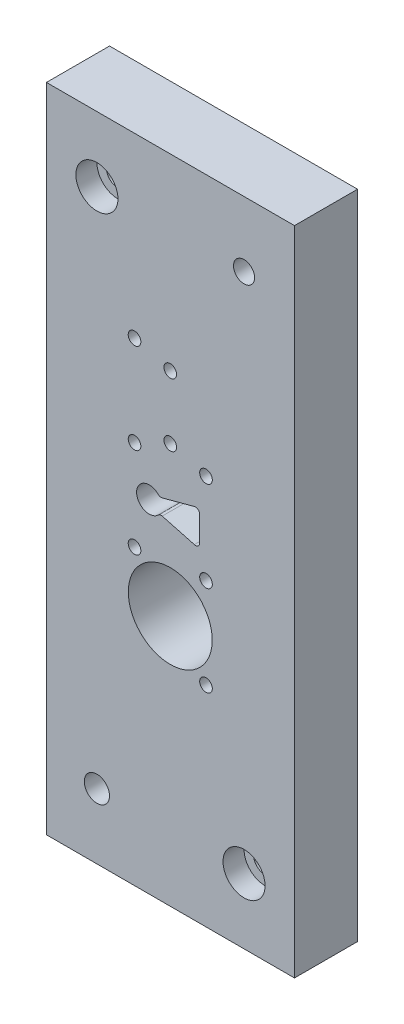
ISO-10303-21;
HEADER;
FILE_DESCRIPTION(('STEP AP214'),'2;1');
FILE_NAME('part.step','',(''),(''),'','','');
FILE_SCHEMA(('AUTOMOTIVE_DESIGN { 1 0 10303 214 1 1 1 1 }'));
ENDSEC;
DATA;
#1=APPLICATION_CONTEXT('core data for automotive mechanical design processes');
#2=APPLICATION_PROTOCOL_DEFINITION('international standard','automotive_design',2000,#1);
#3=PRODUCT_CONTEXT('',#1,'mechanical');
#4=PRODUCT('Part','Part','',(#3));
#5=PRODUCT_RELATED_PRODUCT_CATEGORY('part','',(#4));
#6=PRODUCT_DEFINITION_FORMATION('','',#4);
#7=PRODUCT_DEFINITION_CONTEXT('part definition',#1,'design');
#8=PRODUCT_DEFINITION('design','',#6,#7);
#9=PRODUCT_DEFINITION_SHAPE('','',#8);
#10=(LENGTH_UNIT() NAMED_UNIT(*) SI_UNIT(.MILLI.,.METRE.));
#11=(NAMED_UNIT(*) PLANE_ANGLE_UNIT() SI_UNIT($,.RADIAN.));
#12=(NAMED_UNIT(*) SI_UNIT($,.STERADIAN.) SOLID_ANGLE_UNIT());
#13=UNCERTAINTY_MEASURE_WITH_UNIT(LENGTH_MEASURE(1.E-05),#10,'distance_accuracy_value','');
#14=(GEOMETRIC_REPRESENTATION_CONTEXT(3) GLOBAL_UNCERTAINTY_ASSIGNED_CONTEXT((#13)) GLOBAL_UNIT_ASSIGNED_CONTEXT((#10,
#11,#12)) REPRESENTATION_CONTEXT('',''));
#15=CARTESIAN_POINT('',(0.,0.,0.));
#16=DIRECTION('',(0.,0.,1.));
#17=DIRECTION('',(1.,0.,0.));
#18=AXIS2_PLACEMENT_3D('',#15,#16,#17);
#19=CARTESIAN_POINT('',(-29.5,-77.5,15.));
#20=DIRECTION('',(0.,0.,1.));
#21=DIRECTION('',(1.,0.,0.));
#22=AXIS2_PLACEMENT_3D('',#19,#20,#21);
#23=PLANE('',#22);
#24=CARTESIAN_POINT('',(-2.22157287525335,0.971572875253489,15.));
#25=DIRECTION('',(0.,0.,-1.));
#26=DIRECTION('',(1.,0.,0.));
#27=AXIS2_PLACEMENT_3D('',#24,#25,#26);
#28=CIRCLE('',#27,0.99);
#29=CARTESIAN_POINT('',(-2.92160858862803,1.67160858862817,15.));
#30=VERTEX_POINT('',#29);
#31=CARTESIAN_POINT('',(-1.96534202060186,1.92783944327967,15.));
#32=VERTEX_POINT('',#31);
#33=EDGE_CURVE('E47',#30,#32,#28,.T.);
#34=ORIENTED_EDGE('',*,*,#33,.F.);
#35=CARTESIAN_POINT('',(-5.04999999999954,3.79999999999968,15.));
#36=DIRECTION('',(0.,0.,1.));
#37=DIRECTION('',(1.,0.,0.));
#38=AXIS2_PLACEMENT_3D('',#35,#36,#37);
#39=CIRCLE('',#38,3.01);
#40=CARTESIAN_POINT('',(-2.92160858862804,5.9283914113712,15.));
#41=VERTEX_POINT('',#40);
#42=EDGE_CURVE('E140',#41,#30,#39,.T.);
#43=ORIENTED_EDGE('',*,*,#42,.F.);
#44=CARTESIAN_POINT('',(-2.22157287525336,6.62842712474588,15.));
#45=DIRECTION('',(0.,0.,-1.));
#46=DIRECTION('',(1.,0.,0.));
#47=AXIS2_PLACEMENT_3D('',#44,#45,#46);
#48=CIRCLE('',#47,0.990000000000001);
#49=CARTESIAN_POINT('',(-1.96534202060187,5.6721605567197,15.));
#50=VERTEX_POINT('',#49);
#51=EDGE_CURVE('E143',#50,#41,#48,.T.);
#52=ORIENTED_EDGE('',*,*,#51,.F.);
#53=DIRECTION('',(-0.96592582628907,-0.258819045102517,0.));
#54=VECTOR('',#53,1.);
#55=CARTESIAN_POINT('',(5.68859276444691,7.72302620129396,15.));
#56=LINE('',#55,#54);
#57=CARTESIAN_POINT('',(5.68859276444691,7.72302620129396,15.));
#58=VERTEX_POINT('',#57);
#59=EDGE_CURVE('E171',#58,#50,#56,.T.);
#60=ORIENTED_EDGE('',*,*,#59,.F.);
#61=CARTESIAN_POINT('',(5.95000000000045,6.747441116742,15.));
#62=DIRECTION('',(0.,0.,1.));
#63=DIRECTION('',(1.,0.,0.));
#64=AXIS2_PLACEMENT_3D('',#61,#62,#63);
#65=CIRCLE('',#64,1.01);
#66=CARTESIAN_POINT('',(6.96000000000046,6.747441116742,15.));
#67=VERTEX_POINT('',#66);
#68=EDGE_CURVE('E168',#67,#58,#65,.T.);
#69=ORIENTED_EDGE('',*,*,#68,.F.);
#70=DIRECTION('',(0.,1.,0.));
#71=VECTOR('',#70,1.);
#72=CARTESIAN_POINT('',(6.96000000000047,0.85255888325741,15.));
#73=LINE('',#72,#71);
#74=CARTESIAN_POINT('',(6.96000000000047,0.85255888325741,15.));
#75=VERTEX_POINT('',#74);
#76=EDGE_CURVE('E165',#75,#67,#73,.T.);
#77=ORIENTED_EDGE('',*,*,#76,.F.);
#78=CARTESIAN_POINT('',(5.95000000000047,0.852558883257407,15.));
#79=DIRECTION('',(0.,0.,1.));
#80=DIRECTION('',(1.,0.,0.));
#81=AXIS2_PLACEMENT_3D('',#78,#79,#80);
#82=CIRCLE('',#81,1.01);
#83=CARTESIAN_POINT('',(5.68859276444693,-0.123026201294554,15.));
#84=VERTEX_POINT('',#83);
#85=EDGE_CURVE('E162',#84,#75,#82,.T.);
#86=ORIENTED_EDGE('',*,*,#85,.F.);
#87=DIRECTION('',(0.965925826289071,-0.258819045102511,0.));
#88=VECTOR('',#87,1.);
#89=CARTESIAN_POINT('',(-1.96534202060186,1.92783944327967,15.));
#90=LINE('',#89,#88);
#91=EDGE_CURVE('E160',#32,#84,#90,.T.);
#92=ORIENTED_EDGE('',*,*,#91,.F.);
#93=EDGE_LOOP('',(#34,#43,#52,#60,#69,#77,#86,#92));
#94=FACE_BOUND('',#93,.T.);
#95=CARTESIAN_POINT('',(-0.0499999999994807,-17.7000000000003,15.));
#96=DIRECTION('',(0.,0.,1.));
#97=DIRECTION('',(1.,0.,0.));
#98=AXIS2_PLACEMENT_3D('',#95,#96,#97);
#99=CIRCLE('',#98,9.98);
#100=CARTESIAN_POINT('',(9.93000000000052,-17.7000000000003,15.));
#101=VERTEX_POINT('',#100);
#102=EDGE_CURVE('E178',#101,#101,#99,.T.);
#103=ORIENTED_EDGE('',*,*,#102,.F.);
#104=EDGE_LOOP('',(#103));
#105=FACE_BOUND('',#104,.T.);
#106=CARTESIAN_POINT('',(8.45000000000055,-27.667948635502,15.));
#107=DIRECTION('',(0.,0.,1.));
#108=DIRECTION('',(1.,0.,0.));
#109=AXIS2_PLACEMENT_3D('',#106,#107,#108);
#110=CIRCLE('',#109,1.5035);
#111=CARTESIAN_POINT('',(9.95350000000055,-27.667948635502,15.));
#112=VERTEX_POINT('',#111);
#113=EDGE_CURVE('E193',#112,#112,#110,.T.);
#114=ORIENTED_EDGE('',*,*,#113,.F.);
#115=EDGE_LOOP('',(#114));
#116=FACE_BOUND('',#115,.T.);
#117=CARTESIAN_POINT('',(-8.5499999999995,-7.73205136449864,15.));
#118=DIRECTION('',(0.,0.,1.));
#119=DIRECTION('',(1.,0.,0.));
#120=AXIS2_PLACEMENT_3D('',#117,#118,#119);
#121=CIRCLE('',#120,1.5035);
#122=CARTESIAN_POINT('',(-7.0464999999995,-7.73205136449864,15.));
#123=VERTEX_POINT('',#122);
#124=EDGE_CURVE('E199',#123,#123,#121,.T.);
#125=ORIENTED_EDGE('',*,*,#124,.F.);
#126=EDGE_LOOP('',(#125));
#127=FACE_BOUND('',#126,.T.);
#128=CARTESIAN_POINT('',(8.45000000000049,-6.16794863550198,15.));
#129=DIRECTION('',(0.,0.,1.));
#130=DIRECTION('',(1.,0.,0.));
#131=AXIS2_PLACEMENT_3D('',#128,#129,#130);
#132=CIRCLE('',#131,1.5035);
#133=CARTESIAN_POINT('',(9.95350000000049,-6.16794863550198,15.));
#134=VERTEX_POINT('',#133);
#135=EDGE_CURVE('E205',#134,#134,#132,.T.);
#136=ORIENTED_EDGE('',*,*,#135,.F.);
#137=EDGE_LOOP('',(#136));
#138=FACE_BOUND('',#137,.T.);
#139=CARTESIAN_POINT('',(-8.54999999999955,13.7679486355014,15.));
#140=DIRECTION('',(0.,0.,1.));
#141=DIRECTION('',(1.,0.,0.));
#142=AXIS2_PLACEMENT_3D('',#139,#140,#141);
#143=CIRCLE('',#142,1.5035);
#144=CARTESIAN_POINT('',(-7.04649999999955,13.7679486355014,15.));
#145=VERTEX_POINT('',#144);
#146=EDGE_CURVE('E211',#145,#145,#143,.T.);
#147=ORIENTED_EDGE('',*,*,#146,.F.);
#148=EDGE_LOOP('',(#147));
#149=FACE_BOUND('',#148,.T.);
#150=CARTESIAN_POINT('',(8.45000000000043,15.332051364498,15.));
#151=DIRECTION('',(0.,0.,1.));
#152=DIRECTION('',(1.,0.,0.));
#153=AXIS2_PLACEMENT_3D('',#150,#151,#152);
#154=CIRCLE('',#153,1.5035);
#155=CARTESIAN_POINT('',(9.95350000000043,15.332051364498,15.));
#156=VERTEX_POINT('',#155);
#157=EDGE_CURVE('E217',#156,#156,#154,.T.);
#158=ORIENTED_EDGE('',*,*,#157,.F.);
#159=EDGE_LOOP('',(#158));
#160=FACE_BOUND('',#159,.T.);
#161=CARTESIAN_POINT('',(-8.54999999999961,35.2679486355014,15.));
#162=DIRECTION('',(0.,0.,1.));
#163=DIRECTION('',(1.,0.,0.));
#164=AXIS2_PLACEMENT_3D('',#161,#162,#163);
#165=CIRCLE('',#164,1.5035);
#166=CARTESIAN_POINT('',(-7.04649999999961,35.2679486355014,15.));
#167=VERTEX_POINT('',#166);
#168=EDGE_CURVE('E223',#167,#167,#165,.T.);
#169=ORIENTED_EDGE('',*,*,#168,.F.);
#170=EDGE_LOOP('',(#169));
#171=FACE_BOUND('',#170,.T.);
#172=CARTESIAN_POINT('',(-0.0499999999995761,17.7999999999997,15.));
#173=DIRECTION('',(0.,0.,1.));
#174=DIRECTION('',(1.,0.,0.));
#175=AXIS2_PLACEMENT_3D('',#172,#173,#174);
#176=CIRCLE('',#175,1.5035);
#177=CARTESIAN_POINT('',(1.45350000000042,17.7999999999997,15.));
#178=VERTEX_POINT('',#177);
#179=EDGE_CURVE('E229',#178,#178,#176,.T.);
#180=ORIENTED_EDGE('',*,*,#179,.F.);
#181=EDGE_LOOP('',(#180));
#182=FACE_BOUND('',#181,.T.);
#183=CARTESIAN_POINT('',(-0.0499999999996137,32.7999999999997,15.));
#184=DIRECTION('',(0.,0.,1.));
#185=DIRECTION('',(1.,0.,0.));
#186=AXIS2_PLACEMENT_3D('',#183,#184,#185);
#187=CIRCLE('',#186,1.5035);
#188=CARTESIAN_POINT('',(1.45350000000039,32.7999999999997,15.));
#189=VERTEX_POINT('',#188);
#190=EDGE_CURVE('E235',#189,#189,#187,.T.);
#191=ORIENTED_EDGE('',*,*,#190,.F.);
#192=EDGE_LOOP('',(#191));
#193=FACE_BOUND('',#192,.T.);
#194=CARTESIAN_POINT('',(-17.4999999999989,61.9999999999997,15.));
#195=DIRECTION('',(0.,0.,1.));
#196=DIRECTION('',(1.,0.,0.));
#197=AXIS2_PLACEMENT_3D('',#194,#195,#196);
#198=CIRCLE('',#197,5.);
#199=CARTESIAN_POINT('',(-12.4999999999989,61.9999999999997,15.));
#200=VERTEX_POINT('',#199);
#201=EDGE_CURVE('E252',#200,#200,#198,.T.);
#202=ORIENTED_EDGE('',*,*,#201,.F.);
#203=EDGE_LOOP('',(#202));
#204=FACE_BOUND('',#203,.T.);
#205=CARTESIAN_POINT('',(17.5000000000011,-62.0000000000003,15.));
#206=DIRECTION('',(0.,0.,1.));
#207=DIRECTION('',(1.,0.,0.));
#208=AXIS2_PLACEMENT_3D('',#205,#206,#207);
#209=CIRCLE('',#208,5.);
#210=CARTESIAN_POINT('',(22.5000000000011,-62.0000000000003,15.));
#211=VERTEX_POINT('',#210);
#212=EDGE_CURVE('E264',#211,#211,#209,.T.);
#213=ORIENTED_EDGE('',*,*,#212,.F.);
#214=EDGE_LOOP('',(#213));
#215=FACE_BOUND('',#214,.T.);
#216=CARTESIAN_POINT('',(-17.4999999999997,-62.,15.));
#217=DIRECTION('',(0.,0.,1.));
#218=DIRECTION('',(1.,0.,0.));
#219=AXIS2_PLACEMENT_3D('',#216,#217,#218);
#220=CIRCLE('',#219,3.00349999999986);
#221=CARTESIAN_POINT('',(-14.4964999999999,-62.,15.));
#222=VERTEX_POINT('',#221);
#223=EDGE_CURVE('E276',#222,#222,#220,.T.);
#224=ORIENTED_EDGE('',*,*,#223,.F.);
#225=EDGE_LOOP('',(#224));
#226=FACE_BOUND('',#225,.T.);
#227=DIRECTION('',(1.,0.,0.));
#228=VECTOR('',#227,1.);
#229=CARTESIAN_POINT('',(-29.5,-77.5,15.));
#230=LINE('',#229,#228);
#231=CARTESIAN_POINT('',(-29.5,-77.5,15.));
#232=VERTEX_POINT('',#231);
#233=CARTESIAN_POINT('',(29.5,-77.5,15.));
#234=VERTEX_POINT('',#233);
#235=EDGE_CURVE('E288',#232,#234,#230,.T.);
#236=ORIENTED_EDGE('',*,*,#235,.T.);
#237=DIRECTION('',(0.,1.,0.));
#238=VECTOR('',#237,1.);
#239=CARTESIAN_POINT('',(29.5,-77.5,15.));
#240=LINE('',#239,#238);
#241=CARTESIAN_POINT('',(29.5,77.5,15.));
#242=VERTEX_POINT('',#241);
#243=EDGE_CURVE('E291',#234,#242,#240,.T.);
#244=ORIENTED_EDGE('',*,*,#243,.T.);
#245=DIRECTION('',(-1.,0.,0.));
#246=VECTOR('',#245,1.);
#247=CARTESIAN_POINT('',(29.5,77.5,15.));
#248=LINE('',#247,#246);
#249=CARTESIAN_POINT('',(-29.5,77.5,15.));
#250=VERTEX_POINT('',#249);
#251=EDGE_CURVE('E293',#242,#250,#248,.T.);
#252=ORIENTED_EDGE('',*,*,#251,.T.);
#253=DIRECTION('',(0.,-1.,0.));
#254=VECTOR('',#253,1.);
#255=CARTESIAN_POINT('',(-29.5,-77.5,15.));
#256=LINE('',#255,#254);
#257=EDGE_CURVE('E295',#250,#232,#256,.T.);
#258=ORIENTED_EDGE('',*,*,#257,.T.);
#259=EDGE_LOOP('',(#236,#244,#252,#258));
#260=FACE_BOUND('',#259,.T.);
#261=CARTESIAN_POINT('',(17.5000000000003,62.,15.));
#262=DIRECTION('',(0.,0.,1.));
#263=DIRECTION('',(1.,0.,0.));
#264=AXIS2_PLACEMENT_3D('',#261,#262,#263);
#265=CIRCLE('',#264,2.50349999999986);
#266=CARTESIAN_POINT('',(20.0035000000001,62.,15.));
#267=VERTEX_POINT('',#266);
#268=EDGE_CURVE('E270',#267,#267,#265,.T.);
#269=ORIENTED_EDGE('',*,*,#268,.F.);
#270=EDGE_LOOP('',(#269));
#271=FACE_BOUND('',#270,.T.);
#272=ADVANCED_FACE('F32',(#94,#105,#116,#127,#138,#149,#160,#171,#182,#193,#204,#215,#226,#260,
#271),#23,.T.);
#273=CARTESIAN_POINT('',(-29.5,-77.5,0.));
#274=DIRECTION('',(0.,0.,1.));
#275=DIRECTION('',(1.,0.,0.));
#276=AXIS2_PLACEMENT_3D('',#273,#274,#275);
#277=PLANE('',#276);
#278=CARTESIAN_POINT('',(-5.04999999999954,3.79999999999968,0.));
#279=DIRECTION('',(0.,0.,1.));
#280=DIRECTION('',(1.,0.,0.));
#281=AXIS2_PLACEMENT_3D('',#278,#279,#280);
#282=CIRCLE('',#281,3.01);
#283=CARTESIAN_POINT('',(-2.92160858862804,5.9283914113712,0.));
#284=VERTEX_POINT('',#283);
#285=CARTESIAN_POINT('',(-2.92160858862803,1.67160858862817,0.));
#286=VERTEX_POINT('',#285);
#287=EDGE_CURVE('E129',#284,#286,#282,.T.);
#288=ORIENTED_EDGE('',*,*,#287,.T.);
#289=CARTESIAN_POINT('',(-2.22157287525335,0.971572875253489,0.));
#290=DIRECTION('',(0.,0.,-1.));
#291=DIRECTION('',(1.,0.,0.));
#292=AXIS2_PLACEMENT_3D('',#289,#290,#291);
#293=CIRCLE('',#292,0.99);
#294=CARTESIAN_POINT('',(-1.96534202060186,1.92783944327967,0.));
#295=VERTEX_POINT('',#294);
#296=EDGE_CURVE('E123',#286,#295,#293,.T.);
#297=ORIENTED_EDGE('',*,*,#296,.T.);
#298=DIRECTION('',(0.965925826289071,-0.258819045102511,0.));
#299=VECTOR('',#298,1.);
#300=CARTESIAN_POINT('',(-1.96534202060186,1.92783944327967,0.));
#301=LINE('',#300,#299);
#302=CARTESIAN_POINT('',(5.68859276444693,-0.123026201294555,0.));
#303=VERTEX_POINT('',#302);
#304=EDGE_CURVE('E132',#295,#303,#301,.T.);
#305=ORIENTED_EDGE('',*,*,#304,.T.);
#306=CARTESIAN_POINT('',(5.95000000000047,0.852558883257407,0.));
#307=DIRECTION('',(0.,0.,1.));
#308=DIRECTION('',(1.,0.,0.));
#309=AXIS2_PLACEMENT_3D('',#306,#307,#308);
#310=CIRCLE('',#309,1.01);
#311=CARTESIAN_POINT('',(6.96000000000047,0.85255888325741,0.));
#312=VERTEX_POINT('',#311);
#313=EDGE_CURVE('E55',#303,#312,#310,.T.);
#314=ORIENTED_EDGE('',*,*,#313,.T.);
#315=DIRECTION('',(0.,1.,0.));
#316=VECTOR('',#315,1.);
#317=CARTESIAN_POINT('',(6.96000000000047,0.85255888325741,0.));
#318=LINE('',#317,#316);
#319=CARTESIAN_POINT('',(6.96000000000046,6.747441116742,0.));
#320=VERTEX_POINT('',#319);
#321=EDGE_CURVE('E147',#312,#320,#318,.T.);
#322=ORIENTED_EDGE('',*,*,#321,.T.);
#323=CARTESIAN_POINT('',(5.95000000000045,6.747441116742,0.));
#324=DIRECTION('',(0.,0.,1.));
#325=DIRECTION('',(1.,0.,0.));
#326=AXIS2_PLACEMENT_3D('',#323,#324,#325);
#327=CIRCLE('',#326,1.01);
#328=CARTESIAN_POINT('',(5.68859276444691,7.72302620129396,0.));
#329=VERTEX_POINT('',#328);
#330=EDGE_CURVE('E150',#320,#329,#327,.T.);
#331=ORIENTED_EDGE('',*,*,#330,.T.);
#332=DIRECTION('',(-0.96592582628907,-0.258819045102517,0.));
#333=VECTOR('',#332,1.);
#334=CARTESIAN_POINT('',(5.68859276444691,7.72302620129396,0.));
#335=LINE('',#334,#333);
#336=CARTESIAN_POINT('',(-1.96534202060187,5.6721605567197,0.));
#337=VERTEX_POINT('',#336);
#338=EDGE_CURVE('E153',#329,#337,#335,.T.);
#339=ORIENTED_EDGE('',*,*,#338,.T.);
#340=CARTESIAN_POINT('',(-2.22157287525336,6.62842712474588,0.));
#341=DIRECTION('',(0.,0.,-1.));
#342=DIRECTION('',(1.,0.,0.));
#343=AXIS2_PLACEMENT_3D('',#340,#341,#342);
#344=CIRCLE('',#343,0.990000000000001);
#345=EDGE_CURVE('E156',#337,#284,#344,.T.);
#346=ORIENTED_EDGE('',*,*,#345,.T.);
#347=EDGE_LOOP('',(#288,#297,#305,#314,#322,#331,#339,#346));
#348=FACE_BOUND('',#347,.T.);
#349=CARTESIAN_POINT('',(-0.0499999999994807,-17.7000000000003,0.));
#350=DIRECTION('',(0.,0.,1.));
#351=DIRECTION('',(1.,0.,0.));
#352=AXIS2_PLACEMENT_3D('',#349,#350,#351);
#353=CIRCLE('',#352,9.98);
#354=CARTESIAN_POINT('',(9.93000000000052,-17.7000000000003,0.));
#355=VERTEX_POINT('',#354);
#356=EDGE_CURVE('E190',#355,#355,#353,.T.);
#357=ORIENTED_EDGE('',*,*,#356,.T.);
#358=EDGE_LOOP('',(#357));
#359=FACE_BOUND('',#358,.T.);
#360=CARTESIAN_POINT('',(8.45000000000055,-27.667948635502,0.));
#361=DIRECTION('',(0.,0.,1.));
#362=DIRECTION('',(1.,0.,0.));
#363=AXIS2_PLACEMENT_3D('',#360,#361,#362);
#364=CIRCLE('',#363,1.5035);
#365=CARTESIAN_POINT('',(9.95350000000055,-27.667948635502,0.));
#366=VERTEX_POINT('',#365);
#367=EDGE_CURVE('E196',#366,#366,#364,.T.);
#368=ORIENTED_EDGE('',*,*,#367,.T.);
#369=EDGE_LOOP('',(#368));
#370=FACE_BOUND('',#369,.T.);
#371=CARTESIAN_POINT('',(-8.5499999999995,-7.73205136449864,0.));
#372=DIRECTION('',(0.,0.,1.));
#373=DIRECTION('',(1.,0.,0.));
#374=AXIS2_PLACEMENT_3D('',#371,#372,#373);
#375=CIRCLE('',#374,1.5035);
#376=CARTESIAN_POINT('',(-7.0464999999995,-7.73205136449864,0.));
#377=VERTEX_POINT('',#376);
#378=EDGE_CURVE('E202',#377,#377,#375,.T.);
#379=ORIENTED_EDGE('',*,*,#378,.T.);
#380=EDGE_LOOP('',(#379));
#381=FACE_BOUND('',#380,.T.);
#382=CARTESIAN_POINT('',(8.45000000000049,-6.16794863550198,0.));
#383=DIRECTION('',(0.,0.,1.));
#384=DIRECTION('',(1.,0.,0.));
#385=AXIS2_PLACEMENT_3D('',#382,#383,#384);
#386=CIRCLE('',#385,1.5035);
#387=CARTESIAN_POINT('',(9.95350000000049,-6.16794863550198,0.));
#388=VERTEX_POINT('',#387);
#389=EDGE_CURVE('E208',#388,#388,#386,.T.);
#390=ORIENTED_EDGE('',*,*,#389,.T.);
#391=EDGE_LOOP('',(#390));
#392=FACE_BOUND('',#391,.T.);
#393=CARTESIAN_POINT('',(-8.54999999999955,13.7679486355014,0.));
#394=DIRECTION('',(0.,0.,1.));
#395=DIRECTION('',(1.,0.,0.));
#396=AXIS2_PLACEMENT_3D('',#393,#394,#395);
#397=CIRCLE('',#396,1.5035);
#398=CARTESIAN_POINT('',(-7.04649999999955,13.7679486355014,0.));
#399=VERTEX_POINT('',#398);
#400=EDGE_CURVE('E214',#399,#399,#397,.T.);
#401=ORIENTED_EDGE('',*,*,#400,.T.);
#402=EDGE_LOOP('',(#401));
#403=FACE_BOUND('',#402,.T.);
#404=CARTESIAN_POINT('',(8.45000000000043,15.332051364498,0.));
#405=DIRECTION('',(0.,0.,1.));
#406=DIRECTION('',(1.,0.,0.));
#407=AXIS2_PLACEMENT_3D('',#404,#405,#406);
#408=CIRCLE('',#407,1.5035);
#409=CARTESIAN_POINT('',(9.95350000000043,15.332051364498,0.));
#410=VERTEX_POINT('',#409);
#411=EDGE_CURVE('E220',#410,#410,#408,.T.);
#412=ORIENTED_EDGE('',*,*,#411,.T.);
#413=EDGE_LOOP('',(#412));
#414=FACE_BOUND('',#413,.T.);
#415=CARTESIAN_POINT('',(-8.54999999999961,35.2679486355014,0.));
#416=DIRECTION('',(0.,0.,1.));
#417=DIRECTION('',(1.,0.,0.));
#418=AXIS2_PLACEMENT_3D('',#415,#416,#417);
#419=CIRCLE('',#418,1.5035);
#420=CARTESIAN_POINT('',(-7.04649999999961,35.2679486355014,0.));
#421=VERTEX_POINT('',#420);
#422=EDGE_CURVE('E226',#421,#421,#419,.T.);
#423=ORIENTED_EDGE('',*,*,#422,.T.);
#424=EDGE_LOOP('',(#423));
#425=FACE_BOUND('',#424,.T.);
#426=CARTESIAN_POINT('',(-0.0499999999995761,17.7999999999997,0.));
#427=DIRECTION('',(0.,0.,1.));
#428=DIRECTION('',(1.,0.,0.));
#429=AXIS2_PLACEMENT_3D('',#426,#427,#428);
#430=CIRCLE('',#429,1.5035);
#431=CARTESIAN_POINT('',(1.45350000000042,17.7999999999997,0.));
#432=VERTEX_POINT('',#431);
#433=EDGE_CURVE('E232',#432,#432,#430,.T.);
#434=ORIENTED_EDGE('',*,*,#433,.T.);
#435=EDGE_LOOP('',(#434));
#436=FACE_BOUND('',#435,.T.);
#437=CARTESIAN_POINT('',(-0.0499999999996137,32.7999999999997,0.));
#438=DIRECTION('',(0.,0.,1.));
#439=DIRECTION('',(1.,0.,0.));
#440=AXIS2_PLACEMENT_3D('',#437,#438,#439);
#441=CIRCLE('',#440,1.5035);
#442=CARTESIAN_POINT('',(1.45350000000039,32.7999999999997,0.));
#443=VERTEX_POINT('',#442);
#444=EDGE_CURVE('E238',#443,#443,#441,.T.);
#445=ORIENTED_EDGE('',*,*,#444,.T.);
#446=EDGE_LOOP('',(#445));
#447=FACE_BOUND('',#446,.T.);
#448=CARTESIAN_POINT('',(-17.4999999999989,61.9999999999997,0.));
#449=DIRECTION('',(0.,0.,1.));
#450=DIRECTION('',(1.,0.,0.));
#451=AXIS2_PLACEMENT_3D('',#448,#449,#450);
#452=CIRCLE('',#451,2.75);
#453=CARTESIAN_POINT('',(-14.7499999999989,61.9999999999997,0.));
#454=VERTEX_POINT('',#453);
#455=EDGE_CURVE('E241',#454,#454,#452,.T.);
#456=ORIENTED_EDGE('',*,*,#455,.T.);
#457=EDGE_LOOP('',(#456));
#458=FACE_BOUND('',#457,.T.);
#459=CARTESIAN_POINT('',(17.5000000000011,-62.0000000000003,0.));
#460=DIRECTION('',(0.,0.,1.));
#461=DIRECTION('',(1.,0.,0.));
#462=AXIS2_PLACEMENT_3D('',#459,#460,#461);
#463=CIRCLE('',#462,2.75);
#464=CARTESIAN_POINT('',(20.2500000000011,-62.0000000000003,0.));
#465=VERTEX_POINT('',#464);
#466=EDGE_CURVE('E255',#465,#465,#463,.T.);
#467=ORIENTED_EDGE('',*,*,#466,.T.);
#468=EDGE_LOOP('',(#467));
#469=FACE_BOUND('',#468,.T.);
#470=CARTESIAN_POINT('',(-17.4999999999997,-62.,0.));
#471=DIRECTION('',(0.,0.,1.));
#472=DIRECTION('',(1.,0.,0.));
#473=AXIS2_PLACEMENT_3D('',#470,#471,#472);
#474=CIRCLE('',#473,3.00349999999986);
#475=CARTESIAN_POINT('',(-14.4964999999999,-62.,0.));
#476=VERTEX_POINT('',#475);
#477=EDGE_CURVE('E273',#476,#476,#474,.T.);
#478=ORIENTED_EDGE('',*,*,#477,.T.);
#479=EDGE_LOOP('',(#478));
#480=FACE_BOUND('',#479,.T.);
#481=DIRECTION('',(1.,0.,0.));
#482=VECTOR('',#481,1.);
#483=CARTESIAN_POINT('',(-29.5,-77.5,0.));
#484=LINE('',#483,#482);
#485=CARTESIAN_POINT('',(-29.5,-77.5,0.));
#486=VERTEX_POINT('',#485);
#487=CARTESIAN_POINT('',(29.5,-77.5,0.));
#488=VERTEX_POINT('',#487);
#489=EDGE_CURVE('E279',#486,#488,#484,.T.);
#490=ORIENTED_EDGE('',*,*,#489,.F.);
#491=DIRECTION('',(0.,-1.,0.));
#492=VECTOR('',#491,1.);
#493=CARTESIAN_POINT('',(-29.5,-77.5,0.));
#494=LINE('',#493,#492);
#495=CARTESIAN_POINT('',(-29.5,77.5,0.));
#496=VERTEX_POINT('',#495);
#497=EDGE_CURVE('E286',#496,#486,#494,.T.);
#498=ORIENTED_EDGE('',*,*,#497,.F.);
#499=DIRECTION('',(-1.,0.,0.));
#500=VECTOR('',#499,1.);
#501=CARTESIAN_POINT('',(29.5,77.5,0.));
#502=LINE('',#501,#500);
#503=CARTESIAN_POINT('',(29.5,77.5,0.));
#504=VERTEX_POINT('',#503);
#505=EDGE_CURVE('E284',#504,#496,#502,.T.);
#506=ORIENTED_EDGE('',*,*,#505,.F.);
#507=DIRECTION('',(0.,1.,0.));
#508=VECTOR('',#507,1.);
#509=CARTESIAN_POINT('',(29.5,-77.5,0.));
#510=LINE('',#509,#508);
#511=EDGE_CURVE('E282',#488,#504,#510,.T.);
#512=ORIENTED_EDGE('',*,*,#511,.F.);
#513=EDGE_LOOP('',(#490,#498,#506,#512));
#514=FACE_BOUND('',#513,.T.);
#515=CARTESIAN_POINT('',(17.5000000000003,62.,0.));
#516=DIRECTION('',(0.,0.,1.));
#517=DIRECTION('',(1.,0.,0.));
#518=AXIS2_PLACEMENT_3D('',#515,#516,#517);
#519=CIRCLE('',#518,2.50349999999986);
#520=CARTESIAN_POINT('',(20.0035000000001,62.,0.));
#521=VERTEX_POINT('',#520);
#522=EDGE_CURVE('E267',#521,#521,#519,.T.);
#523=ORIENTED_EDGE('',*,*,#522,.T.);
#524=EDGE_LOOP('',(#523));
#525=FACE_BOUND('',#524,.T.);
#526=ADVANCED_FACE('F136',(#348,#359,#370,#381,#392,#403,#414,#425,#436,#447,#458,#469,#480,
#514,#525),#277,.F.);
#527=CARTESIAN_POINT('',(-29.5,-77.5,15.));
#528=DIRECTION('',(0.,1.,0.));
#529=DIRECTION('',(-1.,0.,0.));
#530=AXIS2_PLACEMENT_3D('',#527,#528,#529);
#531=PLANE('',#530);
#532=ORIENTED_EDGE('',*,*,#489,.T.);
#533=DIRECTION('',(0.,0.,-1.));
#534=VECTOR('',#533,1.);
#535=CARTESIAN_POINT('',(29.5,-77.5,15.));
#536=LINE('',#535,#534);
#537=EDGE_CURVE('E11',#234,#488,#536,.T.);
#538=ORIENTED_EDGE('',*,*,#537,.F.);
#539=ORIENTED_EDGE('',*,*,#235,.F.);
#540=DIRECTION('',(0.,0.,-1.));
#541=VECTOR('',#540,1.);
#542=CARTESIAN_POINT('',(-29.5,-77.5,15.));
#543=LINE('',#542,#541);
#544=EDGE_CURVE('E297',#232,#486,#543,.T.);
#545=ORIENTED_EDGE('',*,*,#544,.T.);
#546=EDGE_LOOP('',(#532,#538,#539,#545));
#547=FACE_BOUND('',#546,.T.);
#548=ADVANCED_FACE('F34',(#547),#531,.F.);
#549=CARTESIAN_POINT('',(29.5,-77.5,15.));
#550=DIRECTION('',(-1.,0.,0.));
#551=DIRECTION('',(0.,-1.,0.));
#552=AXIS2_PLACEMENT_3D('',#549,#550,#551);
#553=PLANE('',#552);
#554=ORIENTED_EDGE('',*,*,#511,.T.);
#555=DIRECTION('',(0.,0.,-1.));
#556=VECTOR('',#555,1.);
#557=CARTESIAN_POINT('',(29.5,77.5,15.));
#558=LINE('',#557,#556);
#559=EDGE_CURVE('E40',#242,#504,#558,.T.);
#560=ORIENTED_EDGE('',*,*,#559,.F.);
#561=ORIENTED_EDGE('',*,*,#243,.F.);
#562=ORIENTED_EDGE('',*,*,#537,.T.);
#563=EDGE_LOOP('',(#554,#560,#561,#562));
#564=FACE_BOUND('',#563,.T.);
#565=ADVANCED_FACE('F323',(#564),#553,.F.);
#566=CARTESIAN_POINT('',(29.5,77.5,15.));
#567=DIRECTION('',(0.,-1.,0.));
#568=DIRECTION('',(1.,0.,0.));
#569=AXIS2_PLACEMENT_3D('',#566,#567,#568);
#570=PLANE('',#569);
#571=ORIENTED_EDGE('',*,*,#505,.T.);
#572=DIRECTION('',(0.,0.,-1.));
#573=VECTOR('',#572,1.);
#574=CARTESIAN_POINT('',(-29.5,77.5,15.));
#575=LINE('',#574,#573);
#576=EDGE_CURVE('E300',#250,#496,#575,.T.);
#577=ORIENTED_EDGE('',*,*,#576,.F.);
#578=ORIENTED_EDGE('',*,*,#251,.F.);
#579=ORIENTED_EDGE('',*,*,#559,.T.);
#580=EDGE_LOOP('',(#571,#577,#578,#579));
#581=FACE_BOUND('',#580,.T.);
#582=ADVANCED_FACE('F307',(#581),#570,.F.);
#583=CARTESIAN_POINT('',(-29.5,-77.5,15.));
#584=DIRECTION('',(1.,0.,0.));
#585=DIRECTION('',(0.,1.,0.));
#586=AXIS2_PLACEMENT_3D('',#583,#584,#585);
#587=PLANE('',#586);
#588=ORIENTED_EDGE('',*,*,#497,.T.);
#589=ORIENTED_EDGE('',*,*,#544,.F.);
#590=ORIENTED_EDGE('',*,*,#257,.F.);
#591=ORIENTED_EDGE('',*,*,#576,.T.);
#592=EDGE_LOOP('',(#588,#589,#590,#591));
#593=FACE_BOUND('',#592,.T.);
#594=ADVANCED_FACE('F316',(#593),#587,.F.);
#595=CARTESIAN_POINT('',(-17.4999999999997,-62.,15.));
#596=DIRECTION('',(0.,0.,-1.));
#597=DIRECTION('',(-1.,0.,0.));
#598=AXIS2_PLACEMENT_3D('',#595,#596,#597);
#599=CYLINDRICAL_SURFACE('',#598,3.00349999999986);
#600=ORIENTED_EDGE('',*,*,#223,.T.);
#601=EDGE_LOOP('',(#600));
#602=FACE_BOUND('',#601,.T.);
#603=ORIENTED_EDGE('',*,*,#477,.F.);
#604=EDGE_LOOP('',(#603));
#605=FACE_BOUND('',#604,.T.);
#606=ADVANCED_FACE('F341',(#602,#605),#599,.F.);
#607=CARTESIAN_POINT('',(17.5000000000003,62.,15.));
#608=DIRECTION('',(0.,0.,-1.));
#609=DIRECTION('',(-1.,0.,0.));
#610=AXIS2_PLACEMENT_3D('',#607,#608,#609);
#611=CYLINDRICAL_SURFACE('',#610,2.50349999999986);
#612=ORIENTED_EDGE('',*,*,#268,.T.);
#613=EDGE_LOOP('',(#612));
#614=FACE_BOUND('',#613,.T.);
#615=ORIENTED_EDGE('',*,*,#522,.F.);
#616=EDGE_LOOP('',(#615));
#617=FACE_BOUND('',#616,.T.);
#618=ADVANCED_FACE('F345',(#614,#617),#611,.F.);
#619=CARTESIAN_POINT('',(17.5000000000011,-62.0000000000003,15.));
#620=DIRECTION('',(0.,0.,1.));
#621=DIRECTION('',(1.,0.,0.));
#622=AXIS2_PLACEMENT_3D('',#619,#620,#621);
#623=CYLINDRICAL_SURFACE('',#622,5.);
#624=CARTESIAN_POINT('',(17.5000000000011,-62.0000000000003,10.));
#625=DIRECTION('',(0.,0.,1.));
#626=DIRECTION('',(1.,0.,0.));
#627=AXIS2_PLACEMENT_3D('',#624,#625,#626);
#628=CIRCLE('',#627,5.);
#629=CARTESIAN_POINT('',(22.5000000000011,-62.0000000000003,10.));
#630=VERTEX_POINT('',#629);
#631=EDGE_CURVE('E261',#630,#630,#628,.T.);
#632=ORIENTED_EDGE('',*,*,#631,.F.);
#633=EDGE_LOOP('',(#632));
#634=FACE_BOUND('',#633,.T.);
#635=ORIENTED_EDGE('',*,*,#212,.T.);
#636=EDGE_LOOP('',(#635));
#637=FACE_BOUND('',#636,.T.);
#638=ADVANCED_FACE('F350',(#634,#637),#623,.F.);
#639=CARTESIAN_POINT('',(20.2500000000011,-62.0000000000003,10.));
#640=DIRECTION('',(0.,0.,-1.));
#641=DIRECTION('',(-1.,0.,0.));
#642=AXIS2_PLACEMENT_3D('',#639,#640,#641);
#643=PLANE('',#642);
#644=CARTESIAN_POINT('',(17.5000000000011,-62.0000000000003,10.));
#645=DIRECTION('',(0.,0.,1.));
#646=DIRECTION('',(1.,0.,0.));
#647=AXIS2_PLACEMENT_3D('',#644,#645,#646);
#648=CIRCLE('',#647,2.75);
#649=CARTESIAN_POINT('',(20.2500000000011,-62.0000000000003,10.));
#650=VERTEX_POINT('',#649);
#651=EDGE_CURVE('E258',#650,#650,#648,.T.);
#652=ORIENTED_EDGE('',*,*,#651,.F.);
#653=EDGE_LOOP('',(#652));
#654=FACE_BOUND('',#653,.T.);
#655=ORIENTED_EDGE('',*,*,#631,.T.);
#656=EDGE_LOOP('',(#655));
#657=FACE_BOUND('',#656,.T.);
#658=ADVANCED_FACE('F357',(#654,#657),#643,.F.);
#659=CARTESIAN_POINT('',(17.5000000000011,-62.0000000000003,15.));
#660=DIRECTION('',(0.,0.,1.));
#661=DIRECTION('',(1.,0.,0.));
#662=AXIS2_PLACEMENT_3D('',#659,#660,#661);
#663=CYLINDRICAL_SURFACE('',#662,2.75);
#664=ORIENTED_EDGE('',*,*,#466,.F.);
#665=EDGE_LOOP('',(#664));
#666=FACE_BOUND('',#665,.T.);
#667=ORIENTED_EDGE('',*,*,#651,.T.);
#668=EDGE_LOOP('',(#667));
#669=FACE_BOUND('',#668,.T.);
#670=ADVANCED_FACE('F361',(#666,#669),#663,.F.);
#671=CARTESIAN_POINT('',(-17.4999999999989,61.9999999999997,15.));
#672=DIRECTION('',(0.,0.,1.));
#673=DIRECTION('',(1.,0.,0.));
#674=AXIS2_PLACEMENT_3D('',#671,#672,#673);
#675=CYLINDRICAL_SURFACE('',#674,5.);
#676=CARTESIAN_POINT('',(-17.4999999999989,61.9999999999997,10.));
#677=DIRECTION('',(0.,0.,1.));
#678=DIRECTION('',(1.,0.,0.));
#679=AXIS2_PLACEMENT_3D('',#676,#677,#678);
#680=CIRCLE('',#679,5.);
#681=CARTESIAN_POINT('',(-12.4999999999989,61.9999999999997,10.));
#682=VERTEX_POINT('',#681);
#683=EDGE_CURVE('E249',#682,#682,#680,.T.);
#684=ORIENTED_EDGE('',*,*,#683,.F.);
#685=EDGE_LOOP('',(#684));
#686=FACE_BOUND('',#685,.T.);
#687=ORIENTED_EDGE('',*,*,#201,.T.);
#688=EDGE_LOOP('',(#687));
#689=FACE_BOUND('',#688,.T.);
#690=ADVANCED_FACE('F365',(#686,#689),#675,.F.);
#691=CARTESIAN_POINT('',(-14.7499999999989,61.9999999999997,10.));
#692=DIRECTION('',(0.,0.,-1.));
#693=DIRECTION('',(-1.,0.,0.));
#694=AXIS2_PLACEMENT_3D('',#691,#692,#693);
#695=PLANE('',#694);
#696=CARTESIAN_POINT('',(-17.4999999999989,61.9999999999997,10.));
#697=DIRECTION('',(0.,0.,1.));
#698=DIRECTION('',(1.,0.,0.));
#699=AXIS2_PLACEMENT_3D('',#696,#697,#698);
#700=CIRCLE('',#699,2.75);
#701=CARTESIAN_POINT('',(-14.7499999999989,61.9999999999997,10.));
#702=VERTEX_POINT('',#701);
#703=EDGE_CURVE('E246',#702,#702,#700,.T.);
#704=ORIENTED_EDGE('',*,*,#703,.F.);
#705=EDGE_LOOP('',(#704));
#706=FACE_BOUND('',#705,.T.);
#707=ORIENTED_EDGE('',*,*,#683,.T.);
#708=EDGE_LOOP('',(#707));
#709=FACE_BOUND('',#708,.T.);
#710=ADVANCED_FACE('F369',(#706,#709),#695,.F.);
#711=CARTESIAN_POINT('',(-17.4999999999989,61.9999999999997,15.));
#712=DIRECTION('',(0.,0.,1.));
#713=DIRECTION('',(1.,0.,0.));
#714=AXIS2_PLACEMENT_3D('',#711,#712,#713);
#715=CYLINDRICAL_SURFACE('',#714,2.75);
#716=ORIENTED_EDGE('',*,*,#455,.F.);
#717=EDGE_LOOP('',(#716));
#718=FACE_BOUND('',#717,.T.);
#719=ORIENTED_EDGE('',*,*,#703,.T.);
#720=EDGE_LOOP('',(#719));
#721=FACE_BOUND('',#720,.T.);
#722=ADVANCED_FACE('F373',(#718,#721),#715,.F.);
#723=CARTESIAN_POINT('',(-0.0499999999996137,32.7999999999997,0.));
#724=DIRECTION('',(0.,0.,1.));
#725=DIRECTION('',(1.,0.,0.));
#726=AXIS2_PLACEMENT_3D('',#723,#724,#725);
#727=CYLINDRICAL_SURFACE('',#726,1.5035);
#728=ORIENTED_EDGE('',*,*,#444,.F.);
#729=EDGE_LOOP('',(#728));
#730=FACE_BOUND('',#729,.T.);
#731=ORIENTED_EDGE('',*,*,#190,.T.);
#732=EDGE_LOOP('',(#731));
#733=FACE_BOUND('',#732,.T.);
#734=ADVANCED_FACE('F377',(#730,#733),#727,.F.);
#735=CARTESIAN_POINT('',(-0.0499999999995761,17.7999999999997,0.));
#736=DIRECTION('',(0.,0.,1.));
#737=DIRECTION('',(1.,0.,0.));
#738=AXIS2_PLACEMENT_3D('',#735,#736,#737);
#739=CYLINDRICAL_SURFACE('',#738,1.5035);
#740=ORIENTED_EDGE('',*,*,#433,.F.);
#741=EDGE_LOOP('',(#740));
#742=FACE_BOUND('',#741,.T.);
#743=ORIENTED_EDGE('',*,*,#179,.T.);
#744=EDGE_LOOP('',(#743));
#745=FACE_BOUND('',#744,.T.);
#746=ADVANCED_FACE('F381',(#742,#745),#739,.F.);
#747=CARTESIAN_POINT('',(-8.54999999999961,35.2679486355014,0.));
#748=DIRECTION('',(0.,0.,1.));
#749=DIRECTION('',(1.,0.,0.));
#750=AXIS2_PLACEMENT_3D('',#747,#748,#749);
#751=CYLINDRICAL_SURFACE('',#750,1.5035);
#752=ORIENTED_EDGE('',*,*,#422,.F.);
#753=EDGE_LOOP('',(#752));
#754=FACE_BOUND('',#753,.T.);
#755=ORIENTED_EDGE('',*,*,#168,.T.);
#756=EDGE_LOOP('',(#755));
#757=FACE_BOUND('',#756,.T.);
#758=ADVANCED_FACE('F385',(#754,#757),#751,.F.);
#759=CARTESIAN_POINT('',(8.45000000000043,15.332051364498,0.));
#760=DIRECTION('',(0.,0.,1.));
#761=DIRECTION('',(1.,0.,0.));
#762=AXIS2_PLACEMENT_3D('',#759,#760,#761);
#763=CYLINDRICAL_SURFACE('',#762,1.5035);
#764=ORIENTED_EDGE('',*,*,#411,.F.);
#765=EDGE_LOOP('',(#764));
#766=FACE_BOUND('',#765,.T.);
#767=ORIENTED_EDGE('',*,*,#157,.T.);
#768=EDGE_LOOP('',(#767));
#769=FACE_BOUND('',#768,.T.);
#770=ADVANCED_FACE('F389',(#766,#769),#763,.F.);
#771=CARTESIAN_POINT('',(-8.54999999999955,13.7679486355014,0.));
#772=DIRECTION('',(0.,0.,1.));
#773=DIRECTION('',(1.,0.,0.));
#774=AXIS2_PLACEMENT_3D('',#771,#772,#773);
#775=CYLINDRICAL_SURFACE('',#774,1.5035);
#776=ORIENTED_EDGE('',*,*,#400,.F.);
#777=EDGE_LOOP('',(#776));
#778=FACE_BOUND('',#777,.T.);
#779=ORIENTED_EDGE('',*,*,#146,.T.);
#780=EDGE_LOOP('',(#779));
#781=FACE_BOUND('',#780,.T.);
#782=ADVANCED_FACE('F393',(#778,#781),#775,.F.);
#783=CARTESIAN_POINT('',(8.45000000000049,-6.16794863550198,0.));
#784=DIRECTION('',(0.,0.,1.));
#785=DIRECTION('',(1.,0.,0.));
#786=AXIS2_PLACEMENT_3D('',#783,#784,#785);
#787=CYLINDRICAL_SURFACE('',#786,1.5035);
#788=ORIENTED_EDGE('',*,*,#389,.F.);
#789=EDGE_LOOP('',(#788));
#790=FACE_BOUND('',#789,.T.);
#791=ORIENTED_EDGE('',*,*,#135,.T.);
#792=EDGE_LOOP('',(#791));
#793=FACE_BOUND('',#792,.T.);
#794=ADVANCED_FACE('F397',(#790,#793),#787,.F.);
#795=CARTESIAN_POINT('',(-8.5499999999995,-7.73205136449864,0.));
#796=DIRECTION('',(0.,0.,1.));
#797=DIRECTION('',(1.,0.,0.));
#798=AXIS2_PLACEMENT_3D('',#795,#796,#797);
#799=CYLINDRICAL_SURFACE('',#798,1.5035);
#800=ORIENTED_EDGE('',*,*,#378,.F.);
#801=EDGE_LOOP('',(#800));
#802=FACE_BOUND('',#801,.T.);
#803=ORIENTED_EDGE('',*,*,#124,.T.);
#804=EDGE_LOOP('',(#803));
#805=FACE_BOUND('',#804,.T.);
#806=ADVANCED_FACE('F401',(#802,#805),#799,.F.);
#807=CARTESIAN_POINT('',(8.45000000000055,-27.667948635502,0.));
#808=DIRECTION('',(0.,0.,1.));
#809=DIRECTION('',(1.,0.,0.));
#810=AXIS2_PLACEMENT_3D('',#807,#808,#809);
#811=CYLINDRICAL_SURFACE('',#810,1.5035);
#812=ORIENTED_EDGE('',*,*,#367,.F.);
#813=EDGE_LOOP('',(#812));
#814=FACE_BOUND('',#813,.T.);
#815=ORIENTED_EDGE('',*,*,#113,.T.);
#816=EDGE_LOOP('',(#815));
#817=FACE_BOUND('',#816,.T.);
#818=ADVANCED_FACE('F405',(#814,#817),#811,.F.);
#819=CARTESIAN_POINT('',(-0.0499999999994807,-17.7000000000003,0.));
#820=DIRECTION('',(0.,0.,1.));
#821=DIRECTION('',(1.,0.,0.));
#822=AXIS2_PLACEMENT_3D('',#819,#820,#821);
#823=CYLINDRICAL_SURFACE('',#822,9.98);
#824=ORIENTED_EDGE('',*,*,#356,.F.);
#825=EDGE_LOOP('',(#824));
#826=FACE_BOUND('',#825,.T.);
#827=ORIENTED_EDGE('',*,*,#102,.T.);
#828=EDGE_LOOP('',(#827));
#829=FACE_BOUND('',#828,.T.);
#830=ADVANCED_FACE('F409',(#826,#829),#823,.F.);
#831=CARTESIAN_POINT('',(-2.22157287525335,0.971572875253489,0.));
#832=DIRECTION('',(0.,0.,1.));
#833=DIRECTION('',(1.,0.,0.));
#834=AXIS2_PLACEMENT_3D('',#831,#832,#833);
#835=CYLINDRICAL_SURFACE('',#834,0.99);
#836=ORIENTED_EDGE('',*,*,#33,.T.);
#837=DIRECTION('',(0.,0.,1.));
#838=VECTOR('',#837,1.);
#839=CARTESIAN_POINT('',(-1.96534202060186,1.92783944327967,0.));
#840=LINE('',#839,#838);
#841=EDGE_CURVE('E119',#295,#32,#840,.T.);
#842=ORIENTED_EDGE('',*,*,#841,.F.);
#843=ORIENTED_EDGE('',*,*,#296,.F.);
#844=DIRECTION('',(0.,0.,1.));
#845=VECTOR('',#844,1.);
#846=CARTESIAN_POINT('',(-2.92160858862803,1.67160858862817,0.));
#847=LINE('',#846,#845);
#848=EDGE_CURVE('E176',#286,#30,#847,.T.);
#849=ORIENTED_EDGE('',*,*,#848,.T.);
#850=EDGE_LOOP('',(#836,#842,#843,#849));
#851=FACE_BOUND('',#850,.T.);
#852=ADVANCED_FACE('F121',(#851),#835,.T.);
#853=CARTESIAN_POINT('',(-5.04999999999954,3.79999999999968,0.));
#854=DIRECTION('',(0.,0.,1.));
#855=DIRECTION('',(1.,0.,0.));
#856=AXIS2_PLACEMENT_3D('',#853,#854,#855);
#857=CYLINDRICAL_SURFACE('',#856,3.01);
#858=ORIENTED_EDGE('',*,*,#42,.T.);
#859=ORIENTED_EDGE('',*,*,#848,.F.);
#860=ORIENTED_EDGE('',*,*,#287,.F.);
#861=DIRECTION('',(0.,0.,1.));
#862=VECTOR('',#861,1.);
#863=CARTESIAN_POINT('',(-2.92160858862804,5.9283914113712,0.));
#864=LINE('',#863,#862);
#865=EDGE_CURVE('E179',#284,#41,#864,.T.);
#866=ORIENTED_EDGE('',*,*,#865,.T.);
#867=EDGE_LOOP('',(#858,#859,#860,#866));
#868=FACE_BOUND('',#867,.T.);
#869=ADVANCED_FACE('F416',(#868),#857,.F.);
#870=CARTESIAN_POINT('',(-2.22157287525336,6.62842712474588,0.));
#871=DIRECTION('',(0.,0.,1.));
#872=DIRECTION('',(1.,0.,0.));
#873=AXIS2_PLACEMENT_3D('',#870,#871,#872);
#874=CYLINDRICAL_SURFACE('',#873,0.990000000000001);
#875=ORIENTED_EDGE('',*,*,#51,.T.);
#876=ORIENTED_EDGE('',*,*,#865,.F.);
#877=ORIENTED_EDGE('',*,*,#345,.F.);
#878=DIRECTION('',(0.,0.,1.));
#879=VECTOR('',#878,1.);
#880=CARTESIAN_POINT('',(-1.96534202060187,5.6721605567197,0.));
#881=LINE('',#880,#879);
#882=EDGE_CURVE('E181',#337,#50,#881,.T.);
#883=ORIENTED_EDGE('',*,*,#882,.T.);
#884=EDGE_LOOP('',(#875,#876,#877,#883));
#885=FACE_BOUND('',#884,.T.);
#886=ADVANCED_FACE('F433',(#885),#874,.T.);
#887=CARTESIAN_POINT('',(5.68859276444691,7.72302620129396,0.));
#888=DIRECTION('',(-0.258819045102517,0.965925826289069,0.));
#889=DIRECTION('',(-0.96592582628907,-0.258819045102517,0.));
#890=AXIS2_PLACEMENT_3D('',#887,#888,#889);
#891=PLANE('',#890);
#892=ORIENTED_EDGE('',*,*,#59,.T.);
#893=ORIENTED_EDGE('',*,*,#882,.F.);
#894=ORIENTED_EDGE('',*,*,#338,.F.);
#895=DIRECTION('',(0.,0.,1.));
#896=VECTOR('',#895,1.);
#897=CARTESIAN_POINT('',(5.68859276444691,7.72302620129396,0.));
#898=LINE('',#897,#896);
#899=EDGE_CURVE('E183',#329,#58,#898,.T.);
#900=ORIENTED_EDGE('',*,*,#899,.T.);
#901=EDGE_LOOP('',(#892,#893,#894,#900));
#902=FACE_BOUND('',#901,.T.);
#903=ADVANCED_FACE('F429',(#902),#891,.F.);
#904=CARTESIAN_POINT('',(5.95000000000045,6.747441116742,0.));
#905=DIRECTION('',(0.,0.,1.));
#906=DIRECTION('',(1.,0.,0.));
#907=AXIS2_PLACEMENT_3D('',#904,#905,#906);
#908=CYLINDRICAL_SURFACE('',#907,1.01);
#909=ORIENTED_EDGE('',*,*,#68,.T.);
#910=ORIENTED_EDGE('',*,*,#899,.F.);
#911=ORIENTED_EDGE('',*,*,#330,.F.);
#912=DIRECTION('',(0.,0.,1.));
#913=VECTOR('',#912,1.);
#914=CARTESIAN_POINT('',(6.96000000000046,6.747441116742,0.));
#915=LINE('',#914,#913);
#916=EDGE_CURVE('E185',#320,#67,#915,.T.);
#917=ORIENTED_EDGE('',*,*,#916,.T.);
#918=EDGE_LOOP('',(#909,#910,#911,#917));
#919=FACE_BOUND('',#918,.T.);
#920=ADVANCED_FACE('F425',(#919),#908,.F.);
#921=CARTESIAN_POINT('',(6.96000000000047,0.85255888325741,0.));
#922=DIRECTION('',(1.,0.,0.));
#923=DIRECTION('',(0.,1.,0.));
#924=AXIS2_PLACEMENT_3D('',#921,#922,#923);
#925=PLANE('',#924);
#926=ORIENTED_EDGE('',*,*,#76,.T.);
#927=ORIENTED_EDGE('',*,*,#916,.F.);
#928=ORIENTED_EDGE('',*,*,#321,.F.);
#929=DIRECTION('',(0.,0.,1.));
#930=VECTOR('',#929,1.);
#931=CARTESIAN_POINT('',(6.96000000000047,0.85255888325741,0.));
#932=LINE('',#931,#930);
#933=EDGE_CURVE('E187',#312,#75,#932,.T.);
#934=ORIENTED_EDGE('',*,*,#933,.T.);
#935=EDGE_LOOP('',(#926,#927,#928,#934));
#936=FACE_BOUND('',#935,.T.);
#937=ADVANCED_FACE('F422',(#936),#925,.F.);
#938=CARTESIAN_POINT('',(5.95000000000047,0.852558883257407,0.));
#939=DIRECTION('',(0.,0.,1.));
#940=DIRECTION('',(1.,0.,0.));
#941=AXIS2_PLACEMENT_3D('',#938,#939,#940);
#942=CYLINDRICAL_SURFACE('',#941,1.01);
#943=ORIENTED_EDGE('',*,*,#85,.T.);
#944=ORIENTED_EDGE('',*,*,#933,.F.);
#945=ORIENTED_EDGE('',*,*,#313,.F.);
#946=DIRECTION('',(0.,0.,1.));
#947=VECTOR('',#946,1.);
#948=CARTESIAN_POINT('',(5.68859276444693,-0.123026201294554,0.));
#949=LINE('',#948,#947);
#950=EDGE_CURVE('E128',#303,#84,#949,.T.);
#951=ORIENTED_EDGE('',*,*,#950,.T.);
#952=EDGE_LOOP('',(#943,#944,#945,#951));
#953=FACE_BOUND('',#952,.T.);
#954=ADVANCED_FACE('F419',(#953),#942,.F.);
#955=CARTESIAN_POINT('',(-1.96534202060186,1.92783944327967,0.));
#956=DIRECTION('',(-0.258819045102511,-0.965925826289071,0.));
#957=DIRECTION('',(0.965925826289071,-0.258819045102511,0.));
#958=AXIS2_PLACEMENT_3D('',#955,#956,#957);
#959=PLANE('',#958);
#960=ORIENTED_EDGE('',*,*,#91,.T.);
#961=ORIENTED_EDGE('',*,*,#950,.F.);
#962=ORIENTED_EDGE('',*,*,#304,.F.);
#963=ORIENTED_EDGE('',*,*,#841,.T.);
#964=EDGE_LOOP('',(#960,#961,#962,#963));
#965=FACE_BOUND('',#964,.T.);
#966=ADVANCED_FACE('F133',(#965),#959,.F.);
#967=CLOSED_SHELL('',(#272,#526,#548,#565,#582,#594,#606,#618,#638,#658,#670,#690,#710,#722,
#734,#746,#758,#770,#782,#794,#806,#818,#830,#852,#869,#886,#903,#920,#937,#954,#966));
#968=MANIFOLD_SOLID_BREP('B2',#967);
#969=ADVANCED_BREP_SHAPE_REPRESENTATION('',(#18,#968),#14);
#970=SHAPE_DEFINITION_REPRESENTATION(#9,#969);
ENDSEC;
END-ISO-10303-21;
